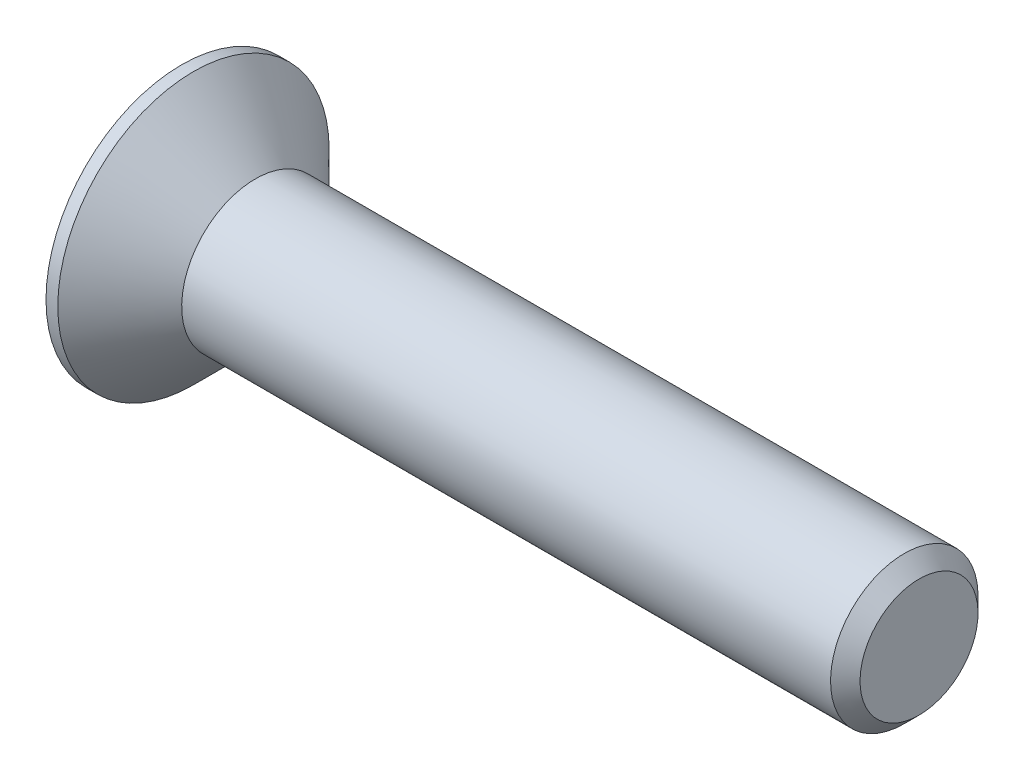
from build123d import *

# Parameters (mm, degrees)
CHAMFER1_SIZE      = 0.5
CUT_EXTRUDE1_DEPTH = 2.1


with BuildPart() as part:
    # Sketch1 → Revolve1 (revolve)
    with BuildSketch(Plane.XY, mode=Mode.PRIVATE) as revolve1_sk:
        Polygon((-2.5, 4.6), (-2.5, 0), (22.5, 0), (22.5, 2.5), (0, 2.5), (-2.1, 4.6), align=None)
    revolve(revolve1_sk.sketch.rotate(Axis((-2.5, 0, 0), (1, 0, 0)), 180), axis=Axis((-2.5, 0, 0), (1, 0, 0)))

    # Chamfer1
    chamfer1_edges = [part.edges().sort_by_distance(p)[0] for p in [
        (22.5, 2.5, 0),
    ]]
    chamfer(chamfer1_edges, length=CHAMFER1_SIZE)

    # Sketch2 → Cut-Extrude1 (cut)
    with BuildSketch(Plane.ZY.offset(2.5)):
        Polygon((-0.575, 2.3), (0.575, 2.3), (0.575, 0.575), (2.3, 0.575), (2.3, -0.575), (0.575, -0.575), (0.575, -2.3), (-0.575, -2.3), (-0.575, -0.575), (-2.3, -0.575), (-2.3, 0.575), (-0.575, 0.575), align=None)
    extrude(amount=-CUT_EXTRUDE1_DEPTH, mode=Mode.SUBTRACT)


solid = part.part
